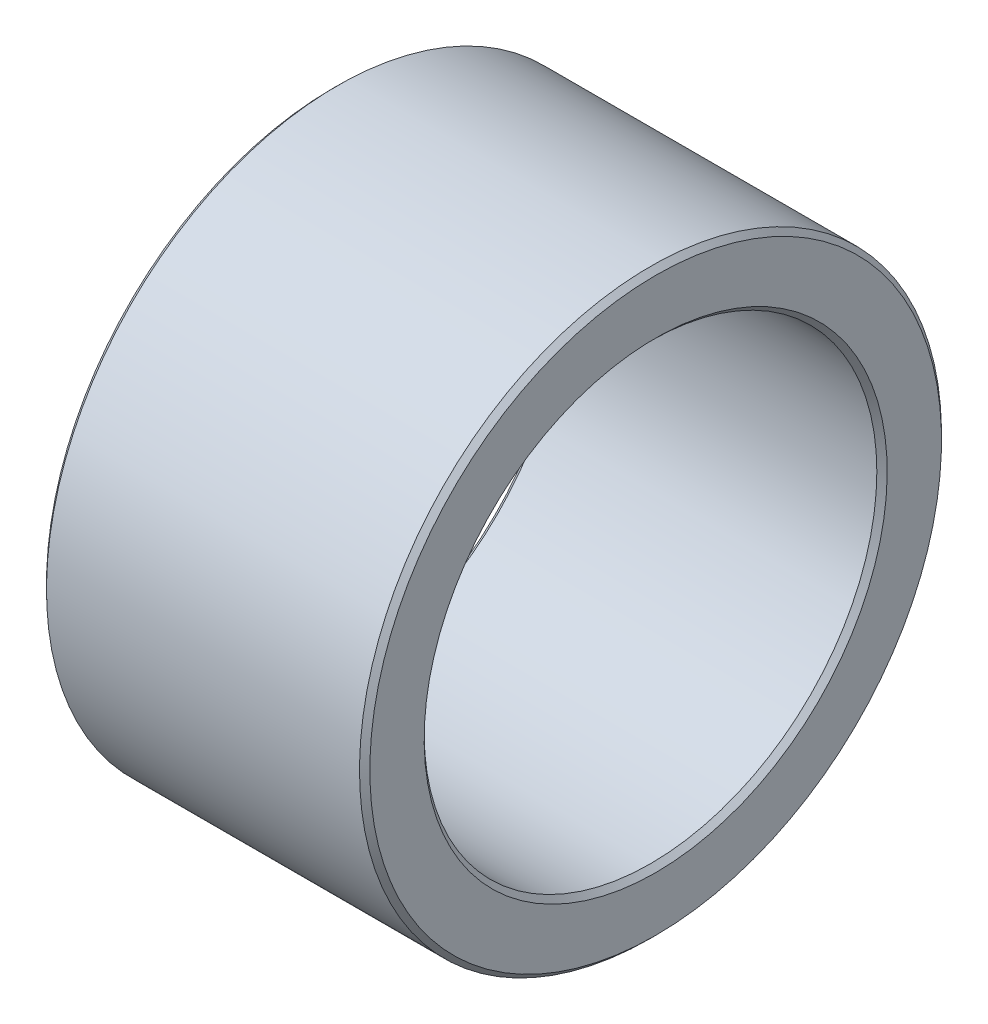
ISO-10303-21;
HEADER;
FILE_DESCRIPTION(('STEP AP214'),'2;1');
FILE_NAME('part.step','',(''),(''),'','','');
FILE_SCHEMA(('AUTOMOTIVE_DESIGN { 1 0 10303 214 1 1 1 1 }'));
ENDSEC;
DATA;
#1=APPLICATION_CONTEXT('core data for automotive mechanical design processes');
#2=APPLICATION_PROTOCOL_DEFINITION('international standard','automotive_design',2000,#1);
#3=PRODUCT_CONTEXT('',#1,'mechanical');
#4=PRODUCT('Part','Part','',(#3));
#5=PRODUCT_RELATED_PRODUCT_CATEGORY('part','',(#4));
#6=PRODUCT_DEFINITION_FORMATION('','',#4);
#7=PRODUCT_DEFINITION_CONTEXT('part definition',#1,'design');
#8=PRODUCT_DEFINITION('design','',#6,#7);
#9=PRODUCT_DEFINITION_SHAPE('','',#8);
#10=(LENGTH_UNIT() NAMED_UNIT(*) SI_UNIT(.MILLI.,.METRE.));
#11=(NAMED_UNIT(*) PLANE_ANGLE_UNIT() SI_UNIT($,.RADIAN.));
#12=(NAMED_UNIT(*) SI_UNIT($,.STERADIAN.) SOLID_ANGLE_UNIT());
#13=UNCERTAINTY_MEASURE_WITH_UNIT(LENGTH_MEASURE(1.E-05),#10,'distance_accuracy_value','');
#14=(GEOMETRIC_REPRESENTATION_CONTEXT(3) GLOBAL_UNCERTAINTY_ASSIGNED_CONTEXT((#13)) GLOBAL_UNIT_ASSIGNED_CONTEXT((#10,
#11,#12)) REPRESENTATION_CONTEXT('',''));
#15=CARTESIAN_POINT('',(0.,0.,0.));
#16=DIRECTION('',(0.,0.,1.));
#17=DIRECTION('',(1.,0.,0.));
#18=AXIS2_PLACEMENT_3D('',#15,#16,#17);
#19=CARTESIAN_POINT('',(0.,-20.,0.));
#20=DIRECTION('',(-1.,0.,0.));
#21=DIRECTION('',(0.,1.,0.));
#22=AXIS2_PLACEMENT_3D('',#19,#20,#21);
#23=PLANE('',#22);
#24=CARTESIAN_POINT('',(0.,0.,0.));
#25=DIRECTION('',(1.,0.,0.));
#26=DIRECTION('',(0.,-1.,0.));
#27=AXIS2_PLACEMENT_3D('',#24,#25,#26);
#28=CIRCLE('',#27,17.9);
#29=CARTESIAN_POINT('',(0.,-17.9,0.));
#30=VERTEX_POINT('',#29);
#31=EDGE_CURVE('E9',#30,#30,#28,.T.);
#32=ORIENTED_EDGE('',*,*,#31,.T.);
#33=EDGE_LOOP('',(#32));
#34=FACE_BOUND('',#33,.T.);
#35=CARTESIAN_POINT('',(0.,0.,0.));
#36=DIRECTION('',(1.,0.,0.));
#37=DIRECTION('',(0.,-1.,0.));
#38=AXIS2_PLACEMENT_3D('',#35,#36,#37);
#39=CIRCLE('',#38,22.1);
#40=CARTESIAN_POINT('',(0.,-22.1,0.));
#41=VERTEX_POINT('',#40);
#42=EDGE_CURVE('E53',#41,#41,#39,.T.);
#43=ORIENTED_EDGE('',*,*,#42,.F.);
#44=EDGE_LOOP('',(#43));
#45=FACE_BOUND('',#44,.T.);
#46=ADVANCED_FACE('F15',(#34,#45),#23,.T.);
#47=CARTESIAN_POINT('',(0.2,0.,0.));
#48=DIRECTION('',(-1.,0.,0.));
#49=DIRECTION('',(0.,-1.,0.));
#50=AXIS2_PLACEMENT_3D('',#47,#48,#49);
#51=CONICAL_SURFACE('',#50,17.7,0.78539816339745);
#52=CARTESIAN_POINT('',(0.4,0.,0.));
#53=DIRECTION('',(1.,0.,0.));
#54=DIRECTION('',(0.,-1.,0.));
#55=AXIS2_PLACEMENT_3D('',#52,#53,#54);
#56=CIRCLE('',#55,17.5);
#57=CARTESIAN_POINT('',(0.4,-17.5,0.));
#58=VERTEX_POINT('',#57);
#59=EDGE_CURVE('E22',#58,#58,#56,.T.);
#60=ORIENTED_EDGE('',*,*,#59,.T.);
#61=EDGE_LOOP('',(#60));
#62=FACE_BOUND('',#61,.T.);
#63=ORIENTED_EDGE('',*,*,#31,.F.);
#64=EDGE_LOOP('',(#63));
#65=FACE_BOUND('',#64,.T.);
#66=ADVANCED_FACE('F82',(#62,#65),#51,.F.);
#67=CARTESIAN_POINT('',(12.5,0.,0.));
#68=DIRECTION('',(-1.,0.,0.));
#69=DIRECTION('',(0.,-1.,0.));
#70=AXIS2_PLACEMENT_3D('',#67,#68,#69);
#71=CYLINDRICAL_SURFACE('',#70,17.5);
#72=CARTESIAN_POINT('',(24.6,0.,0.));
#73=DIRECTION('',(1.,0.,0.));
#74=DIRECTION('',(0.,-1.,0.));
#75=AXIS2_PLACEMENT_3D('',#72,#73,#74);
#76=CIRCLE('',#75,17.5);
#77=CARTESIAN_POINT('',(24.6,-17.5,0.));
#78=VERTEX_POINT('',#77);
#79=EDGE_CURVE('E58',#78,#78,#76,.T.);
#80=ORIENTED_EDGE('',*,*,#79,.T.);
#81=EDGE_LOOP('',(#80));
#82=FACE_BOUND('',#81,.T.);
#83=ORIENTED_EDGE('',*,*,#59,.F.);
#84=EDGE_LOOP('',(#83));
#85=FACE_BOUND('',#84,.T.);
#86=ADVANCED_FACE('F66',(#82,#85),#71,.F.);
#87=CARTESIAN_POINT('',(24.8,0.,0.));
#88=DIRECTION('',(1.,0.,0.));
#89=DIRECTION('',(0.,-1.,0.));
#90=AXIS2_PLACEMENT_3D('',#87,#88,#89);
#91=CONICAL_SURFACE('',#90,17.7,0.785398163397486);
#92=CARTESIAN_POINT('',(25.,0.,0.));
#93=DIRECTION('',(1.,0.,0.));
#94=DIRECTION('',(0.,-1.,0.));
#95=AXIS2_PLACEMENT_3D('',#92,#93,#94);
#96=CIRCLE('',#95,17.9);
#97=CARTESIAN_POINT('',(25.,-17.9,0.));
#98=VERTEX_POINT('',#97);
#99=EDGE_CURVE('E63',#98,#98,#96,.T.);
#100=ORIENTED_EDGE('',*,*,#99,.T.);
#101=EDGE_LOOP('',(#100));
#102=FACE_BOUND('',#101,.T.);
#103=ORIENTED_EDGE('',*,*,#79,.F.);
#104=EDGE_LOOP('',(#103));
#105=FACE_BOUND('',#104,.T.);
#106=ADVANCED_FACE('F69',(#102,#105),#91,.F.);
#107=CARTESIAN_POINT('',(25.,-20.,0.));
#108=DIRECTION('',(1.,0.,0.));
#109=DIRECTION('',(0.,-1.,0.));
#110=AXIS2_PLACEMENT_3D('',#107,#108,#109);
#111=PLANE('',#110);
#112=CARTESIAN_POINT('',(25.,0.,0.));
#113=DIRECTION('',(1.,0.,0.));
#114=DIRECTION('',(0.,-1.,0.));
#115=AXIS2_PLACEMENT_3D('',#112,#113,#114);
#116=CIRCLE('',#115,22.1);
#117=CARTESIAN_POINT('',(25.,-22.1,0.));
#118=VERTEX_POINT('',#117);
#119=EDGE_CURVE('E61',#118,#118,#116,.T.);
#120=ORIENTED_EDGE('',*,*,#119,.T.);
#121=EDGE_LOOP('',(#120));
#122=FACE_BOUND('',#121,.T.);
#123=ORIENTED_EDGE('',*,*,#99,.F.);
#124=EDGE_LOOP('',(#123));
#125=FACE_BOUND('',#124,.T.);
#126=ADVANCED_FACE('F71',(#122,#125),#111,.T.);
#127=CARTESIAN_POINT('',(24.8,0.,0.));
#128=DIRECTION('',(-1.,0.,0.));
#129=DIRECTION('',(0.,-1.,0.));
#130=AXIS2_PLACEMENT_3D('',#127,#128,#129);
#131=CONICAL_SURFACE('',#130,22.3,0.785398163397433);
#132=CARTESIAN_POINT('',(24.6,0.,0.));
#133=DIRECTION('',(1.,0.,0.));
#134=DIRECTION('',(0.,-1.,0.));
#135=AXIS2_PLACEMENT_3D('',#132,#133,#134);
#136=CIRCLE('',#135,22.5);
#137=CARTESIAN_POINT('',(24.6,-22.5,0.));
#138=VERTEX_POINT('',#137);
#139=EDGE_CURVE('E55',#138,#138,#136,.T.);
#140=ORIENTED_EDGE('',*,*,#139,.T.);
#141=EDGE_LOOP('',(#140));
#142=FACE_BOUND('',#141,.T.);
#143=ORIENTED_EDGE('',*,*,#119,.F.);
#144=EDGE_LOOP('',(#143));
#145=FACE_BOUND('',#144,.T.);
#146=ADVANCED_FACE('F79',(#142,#145),#131,.T.);
#147=CARTESIAN_POINT('',(12.5,0.,0.));
#148=DIRECTION('',(-1.,0.,0.));
#149=DIRECTION('',(0.,-1.,0.));
#150=AXIS2_PLACEMENT_3D('',#147,#148,#149);
#151=CYLINDRICAL_SURFACE('',#150,22.5);
#152=CARTESIAN_POINT('',(0.4,0.,0.));
#153=DIRECTION('',(1.,0.,0.));
#154=DIRECTION('',(0.,-1.,0.));
#155=AXIS2_PLACEMENT_3D('',#152,#153,#154);
#156=CIRCLE('',#155,22.5);
#157=CARTESIAN_POINT('',(0.4,-22.5,0.));
#158=VERTEX_POINT('',#157);
#159=EDGE_CURVE('E49',#158,#158,#156,.T.);
#160=ORIENTED_EDGE('',*,*,#159,.T.);
#161=EDGE_LOOP('',(#160));
#162=FACE_BOUND('',#161,.T.);
#163=ORIENTED_EDGE('',*,*,#139,.F.);
#164=EDGE_LOOP('',(#163));
#165=FACE_BOUND('',#164,.T.);
#166=ADVANCED_FACE('F50',(#162,#165),#151,.T.);
#167=CARTESIAN_POINT('',(0.2,0.,0.));
#168=DIRECTION('',(1.,0.,0.));
#169=DIRECTION('',(0.,-1.,0.));
#170=AXIS2_PLACEMENT_3D('',#167,#168,#169);
#171=CONICAL_SURFACE('',#170,22.3,0.78539816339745);
#172=ORIENTED_EDGE('',*,*,#42,.T.);
#173=EDGE_LOOP('',(#172));
#174=FACE_BOUND('',#173,.T.);
#175=ORIENTED_EDGE('',*,*,#159,.F.);
#176=EDGE_LOOP('',(#175));
#177=FACE_BOUND('',#176,.T.);
#178=ADVANCED_FACE('F92',(#174,#177),#171,.T.);
#179=CLOSED_SHELL('',(#46,#66,#86,#106,#126,#146,#166,#178));
#180=MANIFOLD_SOLID_BREP('B1',#179);
#181=ADVANCED_BREP_SHAPE_REPRESENTATION('',(#18,#180),#14);
#182=SHAPE_DEFINITION_REPRESENTATION(#9,#181);
ENDSEC;
END-ISO-10303-21;
